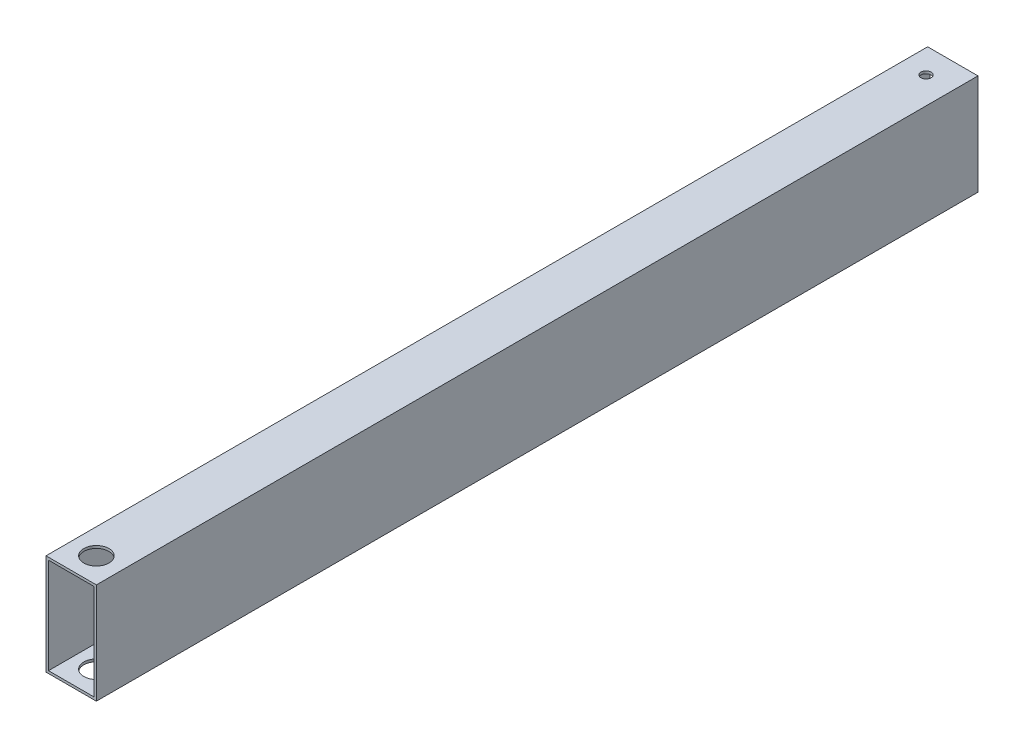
ISO-10303-21;
HEADER;
FILE_DESCRIPTION(('STEP AP214'),'2;1');
FILE_NAME('part.step','',(''),(''),'','','');
FILE_SCHEMA(('AUTOMOTIVE_DESIGN { 1 0 10303 214 1 1 1 1 }'));
ENDSEC;
DATA;
#1=APPLICATION_CONTEXT('core data for automotive mechanical design processes');
#2=APPLICATION_PROTOCOL_DEFINITION('international standard','automotive_design',2000,#1);
#3=PRODUCT_CONTEXT('',#1,'mechanical');
#4=PRODUCT('Part','Part','',(#3));
#5=PRODUCT_RELATED_PRODUCT_CATEGORY('part','',(#4));
#6=PRODUCT_DEFINITION_FORMATION('','',#4);
#7=PRODUCT_DEFINITION_CONTEXT('part definition',#1,'design');
#8=PRODUCT_DEFINITION('design','',#6,#7);
#9=PRODUCT_DEFINITION_SHAPE('','',#8);
#10=(LENGTH_UNIT() NAMED_UNIT(*) SI_UNIT(.MILLI.,.METRE.));
#11=(NAMED_UNIT(*) PLANE_ANGLE_UNIT() SI_UNIT($,.RADIAN.));
#12=(NAMED_UNIT(*) SI_UNIT($,.STERADIAN.) SOLID_ANGLE_UNIT());
#13=UNCERTAINTY_MEASURE_WITH_UNIT(LENGTH_MEASURE(1.E-05),#10,'distance_accuracy_value','');
#14=(GEOMETRIC_REPRESENTATION_CONTEXT(3) GLOBAL_UNCERTAINTY_ASSIGNED_CONTEXT((#13)) GLOBAL_UNIT_ASSIGNED_CONTEXT((#10,
#11,#12)) REPRESENTATION_CONTEXT('',''));
#15=CARTESIAN_POINT('',(0.,0.,0.));
#16=DIRECTION('',(0.,0.,1.));
#17=DIRECTION('',(1.,0.,0.));
#18=AXIS2_PLACEMENT_3D('',#15,#16,#17);
#19=CARTESIAN_POINT('',(0.,80.,700.));
#20=DIRECTION('',(0.,0.,-1.));
#21=DIRECTION('',(-1.,0.,0.));
#22=AXIS2_PLACEMENT_3D('',#19,#20,#21);
#23=PLANE('',#22);
#24=DIRECTION('',(0.,-1.,0.));
#25=VECTOR('',#24,1.);
#26=CARTESIAN_POINT('',(0.,0.,700.));
#27=LINE('',#26,#25);
#28=CARTESIAN_POINT('',(0.,80.,700.));
#29=VERTEX_POINT('',#28);
#30=CARTESIAN_POINT('',(0.,0.,700.));
#31=VERTEX_POINT('',#30);
#32=EDGE_CURVE('E137',#29,#31,#27,.T.);
#33=ORIENTED_EDGE('',*,*,#32,.T.);
#34=DIRECTION('',(1.,0.,0.));
#35=VECTOR('',#34,1.);
#36=CARTESIAN_POINT('',(0.,0.,700.));
#37=LINE('',#36,#35);
#38=CARTESIAN_POINT('',(40.,0.,700.));
#39=VERTEX_POINT('',#38);
#40=EDGE_CURVE('E140',#31,#39,#37,.T.);
#41=ORIENTED_EDGE('',*,*,#40,.T.);
#42=DIRECTION('',(0.,1.,0.));
#43=VECTOR('',#42,1.);
#44=CARTESIAN_POINT('',(40.,0.,700.));
#45=LINE('',#44,#43);
#46=CARTESIAN_POINT('',(40.,80.,700.));
#47=VERTEX_POINT('',#46);
#48=EDGE_CURVE('E143',#39,#47,#45,.T.);
#49=ORIENTED_EDGE('',*,*,#48,.T.);
#50=DIRECTION('',(-1.,0.,0.));
#51=VECTOR('',#50,1.);
#52=CARTESIAN_POINT('',(0.,80.,700.));
#53=LINE('',#52,#51);
#54=EDGE_CURVE('E145',#47,#29,#53,.T.);
#55=ORIENTED_EDGE('',*,*,#54,.T.);
#56=EDGE_LOOP('',(#33,#41,#49,#55));
#57=FACE_BOUND('',#56,.T.);
#58=DIRECTION('',(0.,-1.,0.));
#59=VECTOR('',#58,1.);
#60=CARTESIAN_POINT('',(2.,2.,700.));
#61=LINE('',#60,#59);
#62=CARTESIAN_POINT('',(2.,78.,700.));
#63=VERTEX_POINT('',#62);
#64=CARTESIAN_POINT('',(2.,2.,700.));
#65=VERTEX_POINT('',#64);
#66=EDGE_CURVE('E99',#63,#65,#61,.T.);
#67=ORIENTED_EDGE('',*,*,#66,.F.);
#68=DIRECTION('',(-1.,0.,0.));
#69=VECTOR('',#68,1.);
#70=CARTESIAN_POINT('',(2.,78.,700.));
#71=LINE('',#70,#69);
#72=CARTESIAN_POINT('',(38.,78.,700.));
#73=VERTEX_POINT('',#72);
#74=EDGE_CURVE('E121',#73,#63,#71,.T.);
#75=ORIENTED_EDGE('',*,*,#74,.F.);
#76=DIRECTION('',(0.,1.,0.));
#77=VECTOR('',#76,1.);
#78=CARTESIAN_POINT('',(38.,2.,700.));
#79=LINE('',#78,#77);
#80=CARTESIAN_POINT('',(38.,2.,700.));
#81=VERTEX_POINT('',#80);
#82=EDGE_CURVE('E119',#81,#73,#79,.T.);
#83=ORIENTED_EDGE('',*,*,#82,.F.);
#84=DIRECTION('',(1.,0.,0.));
#85=VECTOR('',#84,1.);
#86=CARTESIAN_POINT('',(2.,2.,700.));
#87=LINE('',#86,#85);
#88=EDGE_CURVE('E107',#65,#81,#87,.T.);
#89=ORIENTED_EDGE('',*,*,#88,.F.);
#90=EDGE_LOOP('',(#67,#75,#83,#89));
#91=FACE_BOUND('',#90,.T.);
#92=ADVANCED_FACE('F32',(#57,#91),#23,.F.);
#93=CARTESIAN_POINT('',(0.,80.,0.));
#94=DIRECTION('',(0.,0.,-1.));
#95=DIRECTION('',(-1.,0.,0.));
#96=AXIS2_PLACEMENT_3D('',#93,#94,#95);
#97=PLANE('',#96);
#98=DIRECTION('',(0.,-1.,0.));
#99=VECTOR('',#98,1.);
#100=CARTESIAN_POINT('',(0.,0.,0.));
#101=LINE('',#100,#99);
#102=CARTESIAN_POINT('',(0.,80.,0.));
#103=VERTEX_POINT('',#102);
#104=CARTESIAN_POINT('',(0.,0.,0.));
#105=VERTEX_POINT('',#104);
#106=EDGE_CURVE('E115',#103,#105,#101,.T.);
#107=ORIENTED_EDGE('',*,*,#106,.F.);
#108=DIRECTION('',(-1.,0.,0.));
#109=VECTOR('',#108,1.);
#110=CARTESIAN_POINT('',(0.,80.,0.));
#111=LINE('',#110,#109);
#112=CARTESIAN_POINT('',(40.,80.,0.));
#113=VERTEX_POINT('',#112);
#114=EDGE_CURVE('E141',#113,#103,#111,.T.);
#115=ORIENTED_EDGE('',*,*,#114,.F.);
#116=DIRECTION('',(0.,1.,0.));
#117=VECTOR('',#116,1.);
#118=CARTESIAN_POINT('',(40.,0.,0.));
#119=LINE('',#118,#117);
#120=CARTESIAN_POINT('',(40.,0.,0.));
#121=VERTEX_POINT('',#120);
#122=EDGE_CURVE('E152',#121,#113,#119,.T.);
#123=ORIENTED_EDGE('',*,*,#122,.F.);
#124=DIRECTION('',(1.,0.,0.));
#125=VECTOR('',#124,1.);
#126=CARTESIAN_POINT('',(0.,0.,0.));
#127=LINE('',#126,#125);
#128=EDGE_CURVE('E150',#105,#121,#127,.T.);
#129=ORIENTED_EDGE('',*,*,#128,.F.);
#130=EDGE_LOOP('',(#107,#115,#123,#129));
#131=FACE_BOUND('',#130,.T.);
#132=DIRECTION('',(-1.,0.,0.));
#133=VECTOR('',#132,1.);
#134=CARTESIAN_POINT('',(2.,78.,0.));
#135=LINE('',#134,#133);
#136=CARTESIAN_POINT('',(38.,78.,0.));
#137=VERTEX_POINT('',#136);
#138=CARTESIAN_POINT('',(2.,78.,0.));
#139=VERTEX_POINT('',#138);
#140=EDGE_CURVE('E108',#137,#139,#135,.T.);
#141=ORIENTED_EDGE('',*,*,#140,.T.);
#142=DIRECTION('',(0.,-1.,0.));
#143=VECTOR('',#142,1.);
#144=CARTESIAN_POINT('',(2.,2.,0.));
#145=LINE('',#144,#143);
#146=CARTESIAN_POINT('',(2.,2.,0.));
#147=VERTEX_POINT('',#146);
#148=EDGE_CURVE('E57',#139,#147,#145,.T.);
#149=ORIENTED_EDGE('',*,*,#148,.T.);
#150=DIRECTION('',(1.,0.,0.));
#151=VECTOR('',#150,1.);
#152=CARTESIAN_POINT('',(2.,2.,0.));
#153=LINE('',#152,#151);
#154=CARTESIAN_POINT('',(38.,2.,0.));
#155=VERTEX_POINT('',#154);
#156=EDGE_CURVE('E114',#147,#155,#153,.T.);
#157=ORIENTED_EDGE('',*,*,#156,.T.);
#158=DIRECTION('',(0.,1.,0.));
#159=VECTOR('',#158,1.);
#160=CARTESIAN_POINT('',(38.,2.,0.));
#161=LINE('',#160,#159);
#162=EDGE_CURVE('E129',#155,#137,#161,.T.);
#163=ORIENTED_EDGE('',*,*,#162,.T.);
#164=EDGE_LOOP('',(#141,#149,#157,#163));
#165=FACE_BOUND('',#164,.T.);
#166=ADVANCED_FACE('F199',(#131,#165),#97,.T.);
#167=CARTESIAN_POINT('',(0.,0.,700.));
#168=DIRECTION('',(1.,0.,0.));
#169=DIRECTION('',(0.,0.,-1.));
#170=AXIS2_PLACEMENT_3D('',#167,#168,#169);
#171=PLANE('',#170);
#172=ORIENTED_EDGE('',*,*,#106,.T.);
#173=DIRECTION('',(0.,0.,-1.));
#174=VECTOR('',#173,1.);
#175=CARTESIAN_POINT('',(0.,0.,700.));
#176=LINE('',#175,#174);
#177=EDGE_CURVE('E11',#31,#105,#176,.T.);
#178=ORIENTED_EDGE('',*,*,#177,.F.);
#179=ORIENTED_EDGE('',*,*,#32,.F.);
#180=DIRECTION('',(0.,0.,-1.));
#181=VECTOR('',#180,1.);
#182=CARTESIAN_POINT('',(0.,80.,700.));
#183=LINE('',#182,#181);
#184=EDGE_CURVE('E147',#29,#103,#183,.T.);
#185=ORIENTED_EDGE('',*,*,#184,.T.);
#186=EDGE_LOOP('',(#172,#178,#179,#185));
#187=FACE_BOUND('',#186,.T.);
#188=ADVANCED_FACE('F34',(#187),#171,.F.);
#189=CARTESIAN_POINT('',(0.,0.,700.));
#190=DIRECTION('',(0.,1.,0.));
#191=DIRECTION('',(0.,0.,1.));
#192=AXIS2_PLACEMENT_3D('',#189,#190,#191);
#193=PLANE('',#192);
#194=CARTESIAN_POINT('',(18.7356936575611,0.,20.));
#195=DIRECTION('',(0.,1.,0.));
#196=DIRECTION('',(0.,0.,1.));
#197=AXIS2_PLACEMENT_3D('',#194,#195,#196);
#198=CIRCLE('',#197,4.);
#199=CARTESIAN_POINT('',(18.7356936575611,0.,24.));
#200=VERTEX_POINT('',#199);
#201=EDGE_CURVE('E181',#200,#200,#198,.T.);
#202=ORIENTED_EDGE('',*,*,#201,.T.);
#203=EDGE_LOOP('',(#202));
#204=FACE_BOUND('',#203,.T.);
#205=CARTESIAN_POINT('',(20.,0.,680.));
#206=DIRECTION('',(0.,1.,0.));
#207=DIRECTION('',(0.,0.,1.));
#208=AXIS2_PLACEMENT_3D('',#205,#206,#207);
#209=CIRCLE('',#208,10.);
#210=CARTESIAN_POINT('',(20.,0.,690.));
#211=VERTEX_POINT('',#210);
#212=EDGE_CURVE('E163',#211,#211,#209,.T.);
#213=ORIENTED_EDGE('',*,*,#212,.T.);
#214=EDGE_LOOP('',(#213));
#215=FACE_BOUND('',#214,.T.);
#216=ORIENTED_EDGE('',*,*,#128,.T.);
#217=DIRECTION('',(0.,0.,-1.));
#218=VECTOR('',#217,1.);
#219=CARTESIAN_POINT('',(40.,0.,700.));
#220=LINE('',#219,#218);
#221=EDGE_CURVE('E41',#39,#121,#220,.T.);
#222=ORIENTED_EDGE('',*,*,#221,.F.);
#223=ORIENTED_EDGE('',*,*,#40,.F.);
#224=ORIENTED_EDGE('',*,*,#177,.T.);
#225=EDGE_LOOP('',(#216,#222,#223,#224));
#226=FACE_BOUND('',#225,.T.);
#227=ADVANCED_FACE('F224',(#204,#215,#226),#193,.F.);
#228=CARTESIAN_POINT('',(40.,0.,700.));
#229=DIRECTION('',(-1.,0.,0.));
#230=DIRECTION('',(0.,0.,1.));
#231=AXIS2_PLACEMENT_3D('',#228,#229,#230);
#232=PLANE('',#231);
#233=ORIENTED_EDGE('',*,*,#122,.T.);
#234=DIRECTION('',(0.,0.,-1.));
#235=VECTOR('',#234,1.);
#236=CARTESIAN_POINT('',(40.,80.,700.));
#237=LINE('',#236,#235);
#238=EDGE_CURVE('E157',#47,#113,#237,.T.);
#239=ORIENTED_EDGE('',*,*,#238,.F.);
#240=ORIENTED_EDGE('',*,*,#48,.F.);
#241=ORIENTED_EDGE('',*,*,#221,.T.);
#242=EDGE_LOOP('',(#233,#239,#240,#241));
#243=FACE_BOUND('',#242,.T.);
#244=ADVANCED_FACE('F221',(#243),#232,.F.);
#245=CARTESIAN_POINT('',(0.,80.,700.));
#246=DIRECTION('',(0.,-1.,0.));
#247=DIRECTION('',(0.,0.,-1.));
#248=AXIS2_PLACEMENT_3D('',#245,#246,#247);
#249=PLANE('',#248);
#250=CARTESIAN_POINT('',(18.7356936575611,80.,20.));
#251=DIRECTION('',(0.,1.,0.));
#252=DIRECTION('',(0.,0.,1.));
#253=AXIS2_PLACEMENT_3D('',#250,#251,#252);
#254=CIRCLE('',#253,4.);
#255=CARTESIAN_POINT('',(18.7356936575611,80.,24.));
#256=VERTEX_POINT('',#255);
#257=EDGE_CURVE('E178',#256,#256,#254,.T.);
#258=ORIENTED_EDGE('',*,*,#257,.F.);
#259=EDGE_LOOP('',(#258));
#260=FACE_BOUND('',#259,.T.);
#261=CARTESIAN_POINT('',(20.,80.,680.));
#262=DIRECTION('',(0.,1.,0.));
#263=DIRECTION('',(0.,0.,1.));
#264=AXIS2_PLACEMENT_3D('',#261,#262,#263);
#265=CIRCLE('',#264,10.);
#266=CARTESIAN_POINT('',(20.,80.,690.));
#267=VERTEX_POINT('',#266);
#268=EDGE_CURVE('E168',#267,#267,#265,.T.);
#269=ORIENTED_EDGE('',*,*,#268,.F.);
#270=EDGE_LOOP('',(#269));
#271=FACE_BOUND('',#270,.T.);
#272=ORIENTED_EDGE('',*,*,#114,.T.);
#273=ORIENTED_EDGE('',*,*,#184,.F.);
#274=ORIENTED_EDGE('',*,*,#54,.F.);
#275=ORIENTED_EDGE('',*,*,#238,.T.);
#276=EDGE_LOOP('',(#272,#273,#274,#275));
#277=FACE_BOUND('',#276,.T.);
#278=ADVANCED_FACE('F218',(#260,#271,#277),#249,.F.);
#279=CARTESIAN_POINT('',(2.,2.,700.));
#280=DIRECTION('',(1.,0.,0.));
#281=DIRECTION('',(0.,0.,-1.));
#282=AXIS2_PLACEMENT_3D('',#279,#280,#281);
#283=PLANE('',#282);
#284=ORIENTED_EDGE('',*,*,#148,.F.);
#285=DIRECTION('',(0.,0.,-1.));
#286=VECTOR('',#285,1.);
#287=CARTESIAN_POINT('',(2.,78.,700.));
#288=LINE('',#287,#286);
#289=EDGE_CURVE('E103',#63,#139,#288,.T.);
#290=ORIENTED_EDGE('',*,*,#289,.F.);
#291=ORIENTED_EDGE('',*,*,#66,.T.);
#292=DIRECTION('',(0.,0.,-1.));
#293=VECTOR('',#292,1.);
#294=CARTESIAN_POINT('',(2.,2.,700.));
#295=LINE('',#294,#293);
#296=EDGE_CURVE('E102',#65,#147,#295,.T.);
#297=ORIENTED_EDGE('',*,*,#296,.T.);
#298=EDGE_LOOP('',(#284,#290,#291,#297));
#299=FACE_BOUND('',#298,.T.);
#300=ADVANCED_FACE('F101',(#299),#283,.T.);
#301=CARTESIAN_POINT('',(2.,2.,700.));
#302=DIRECTION('',(0.,1.,0.));
#303=DIRECTION('',(0.,0.,1.));
#304=AXIS2_PLACEMENT_3D('',#301,#302,#303);
#305=PLANE('',#304);
#306=CARTESIAN_POINT('',(18.7356936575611,2.,20.));
#307=DIRECTION('',(0.,1.,0.));
#308=DIRECTION('',(0.,0.,1.));
#309=AXIS2_PLACEMENT_3D('',#306,#307,#308);
#310=CIRCLE('',#309,4.);
#311=CARTESIAN_POINT('',(18.7356936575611,2.,24.));
#312=VERTEX_POINT('',#311);
#313=EDGE_CURVE('E173',#312,#312,#310,.T.);
#314=ORIENTED_EDGE('',*,*,#313,.F.);
#315=EDGE_LOOP('',(#314));
#316=FACE_BOUND('',#315,.T.);
#317=CARTESIAN_POINT('',(20.,2.,680.));
#318=DIRECTION('',(0.,1.,0.));
#319=DIRECTION('',(0.,0.,1.));
#320=AXIS2_PLACEMENT_3D('',#317,#318,#319);
#321=CIRCLE('',#320,10.);
#322=CARTESIAN_POINT('',(20.,2.,690.));
#323=VERTEX_POINT('',#322);
#324=EDGE_CURVE('E127',#323,#323,#321,.T.);
#325=ORIENTED_EDGE('',*,*,#324,.F.);
#326=EDGE_LOOP('',(#325));
#327=FACE_BOUND('',#326,.T.);
#328=ORIENTED_EDGE('',*,*,#156,.F.);
#329=ORIENTED_EDGE('',*,*,#296,.F.);
#330=ORIENTED_EDGE('',*,*,#88,.T.);
#331=DIRECTION('',(0.,0.,-1.));
#332=VECTOR('',#331,1.);
#333=CARTESIAN_POINT('',(38.,2.,700.));
#334=LINE('',#333,#332);
#335=EDGE_CURVE('E116',#81,#155,#334,.T.);
#336=ORIENTED_EDGE('',*,*,#335,.T.);
#337=EDGE_LOOP('',(#328,#329,#330,#336));
#338=FACE_BOUND('',#337,.T.);
#339=ADVANCED_FACE('F111',(#316,#327,#338),#305,.T.);
#340=CARTESIAN_POINT('',(38.,2.,700.));
#341=DIRECTION('',(-1.,0.,0.));
#342=DIRECTION('',(0.,0.,1.));
#343=AXIS2_PLACEMENT_3D('',#340,#341,#342);
#344=PLANE('',#343);
#345=ORIENTED_EDGE('',*,*,#162,.F.);
#346=ORIENTED_EDGE('',*,*,#335,.F.);
#347=ORIENTED_EDGE('',*,*,#82,.T.);
#348=DIRECTION('',(0.,0.,-1.));
#349=VECTOR('',#348,1.);
#350=CARTESIAN_POINT('',(38.,78.,700.));
#351=LINE('',#350,#349);
#352=EDGE_CURVE('E49',#73,#137,#351,.T.);
#353=ORIENTED_EDGE('',*,*,#352,.T.);
#354=EDGE_LOOP('',(#345,#346,#347,#353));
#355=FACE_BOUND('',#354,.T.);
#356=ADVANCED_FACE('F195',(#355),#344,.T.);
#357=CARTESIAN_POINT('',(2.,78.,700.));
#358=DIRECTION('',(0.,-1.,0.));
#359=DIRECTION('',(0.,0.,-1.));
#360=AXIS2_PLACEMENT_3D('',#357,#358,#359);
#361=PLANE('',#360);
#362=CARTESIAN_POINT('',(18.7356936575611,78.,20.));
#363=DIRECTION('',(0.,-1.,0.));
#364=DIRECTION('',(0.,0.,-1.));
#365=AXIS2_PLACEMENT_3D('',#362,#363,#364);
#366=CIRCLE('',#365,4.);
#367=CARTESIAN_POINT('',(18.7356936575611,78.,16.));
#368=VERTEX_POINT('',#367);
#369=EDGE_CURVE('E36',#368,#368,#366,.T.);
#370=ORIENTED_EDGE('',*,*,#369,.F.);
#371=EDGE_LOOP('',(#370));
#372=FACE_BOUND('',#371,.T.);
#373=CARTESIAN_POINT('',(20.,78.,680.));
#374=DIRECTION('',(0.,-1.,0.));
#375=DIRECTION('',(0.,0.,-1.));
#376=AXIS2_PLACEMENT_3D('',#373,#374,#375);
#377=CIRCLE('',#376,10.);
#378=CARTESIAN_POINT('',(20.,78.,670.));
#379=VERTEX_POINT('',#378);
#380=EDGE_CURVE('E161',#379,#379,#377,.T.);
#381=ORIENTED_EDGE('',*,*,#380,.F.);
#382=EDGE_LOOP('',(#381));
#383=FACE_BOUND('',#382,.T.);
#384=ORIENTED_EDGE('',*,*,#140,.F.);
#385=ORIENTED_EDGE('',*,*,#352,.F.);
#386=ORIENTED_EDGE('',*,*,#74,.T.);
#387=ORIENTED_EDGE('',*,*,#289,.T.);
#388=EDGE_LOOP('',(#384,#385,#386,#387));
#389=FACE_BOUND('',#388,.T.);
#390=ADVANCED_FACE('F191',(#372,#383,#389),#361,.T.);
#391=CARTESIAN_POINT('',(20.,0.,680.));
#392=DIRECTION('',(0.,1.,0.));
#393=DIRECTION('',(0.,0.,1.));
#394=AXIS2_PLACEMENT_3D('',#391,#392,#393);
#395=CYLINDRICAL_SURFACE('',#394,10.);
#396=ORIENTED_EDGE('',*,*,#380,.T.);
#397=EDGE_LOOP('',(#396));
#398=FACE_BOUND('',#397,.T.);
#399=ORIENTED_EDGE('',*,*,#268,.T.);
#400=EDGE_LOOP('',(#399));
#401=FACE_BOUND('',#400,.T.);
#402=ADVANCED_FACE('F194',(#398,#401),#395,.F.);
#403=ORIENTED_EDGE('',*,*,#324,.T.);
#404=EDGE_LOOP('',(#403));
#405=FACE_BOUND('',#404,.T.);
#406=ORIENTED_EDGE('',*,*,#212,.F.);
#407=EDGE_LOOP('',(#406));
#408=FACE_BOUND('',#407,.T.);
#409=ADVANCED_FACE('F301',(#405,#408),#395,.F.);
#410=CARTESIAN_POINT('',(18.7356936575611,0.,20.));
#411=DIRECTION('',(0.,1.,0.));
#412=DIRECTION('',(0.,0.,1.));
#413=AXIS2_PLACEMENT_3D('',#410,#411,#412);
#414=CYLINDRICAL_SURFACE('',#413,4.);
#415=ORIENTED_EDGE('',*,*,#369,.T.);
#416=EDGE_LOOP('',(#415));
#417=FACE_BOUND('',#416,.T.);
#418=ORIENTED_EDGE('',*,*,#257,.T.);
#419=EDGE_LOOP('',(#418));
#420=FACE_BOUND('',#419,.T.);
#421=ADVANCED_FACE('F188',(#417,#420),#414,.F.);
#422=ORIENTED_EDGE('',*,*,#313,.T.);
#423=EDGE_LOOP('',(#422));
#424=FACE_BOUND('',#423,.T.);
#425=ORIENTED_EDGE('',*,*,#201,.F.);
#426=EDGE_LOOP('',(#425));
#427=FACE_BOUND('',#426,.T.);
#428=ADVANCED_FACE('F314',(#424,#427),#414,.F.);
#429=CLOSED_SHELL('',(#92,#166,#188,#227,#244,#278,#300,#339,#356,#390,#402,#409,#421,#428));
#430=MANIFOLD_SOLID_BREP('B2',#429);
#431=ADVANCED_BREP_SHAPE_REPRESENTATION('',(#18,#430),#14);
#432=SHAPE_DEFINITION_REPRESENTATION(#9,#431);
ENDSEC;
END-ISO-10303-21;
